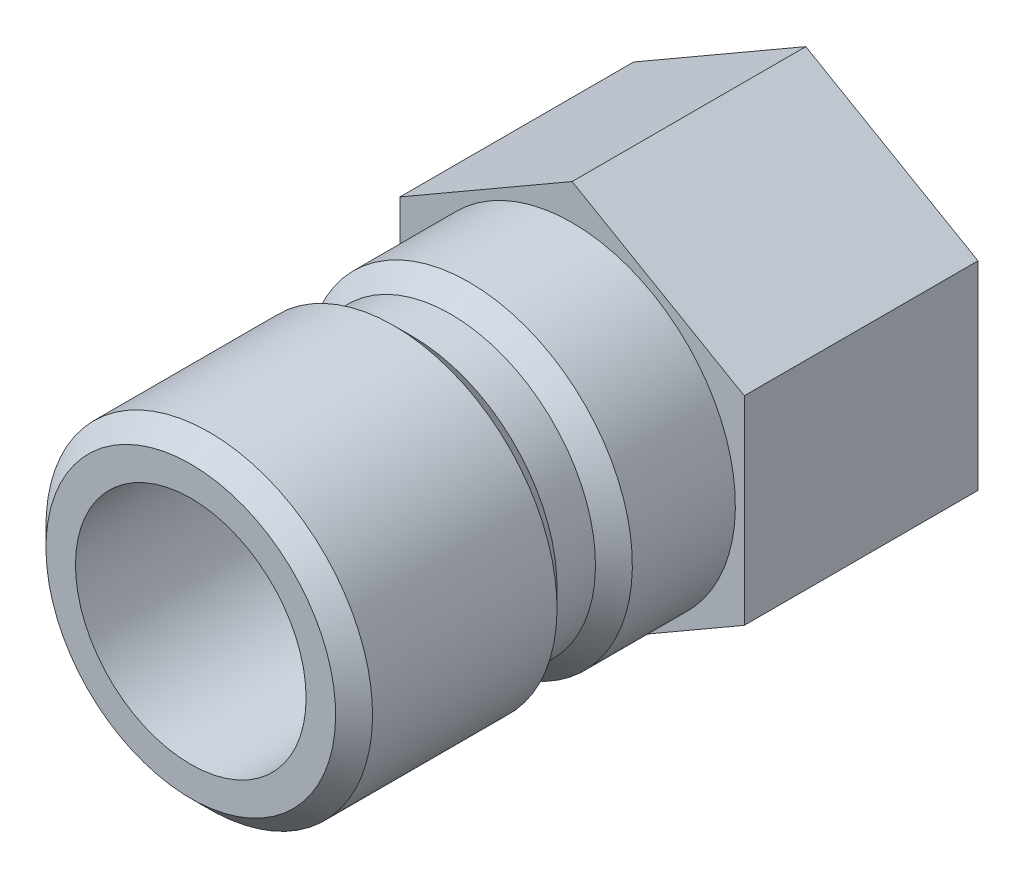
from build123d import *

# Parameters (mm, degrees)
SKETCH2_OUTSIDE_W  = 26.548
SKETCH2_OUTSIDE_H  = 26.548
CUT_EXTRUDE1_DEPTH = 21.011720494


with BuildPart() as part:
    # Sketch1 → Revolve1 (revolve)
    with BuildSketch(Plane(origin=(0, 0, 0), x_dir=(0, 0, -1), z_dir=(1, 0, 0))):
        Polygon((-15.748, 4.7625), (-15.748, 5.9817), (-14.986, 6.7437), (-7.366, 6.7437), (-6.604, 5.9817), (-5.0165, 5.9817), (-4.2545, 6.7437), (0, 6.7437), (0, 8.73125), (9.652, 8.73125), (9.652, 4.553345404), (1.7145, 4.3053), (1.7145, 4.7625), align=None)
    revolve(axis=Axis((0, 0, 0), (0, 0, 1)))

    # Sketch2 outside → Cut-Extrude1 (cut, through all)
    with BuildSketch(Plane.XY):
        Rectangle(SKETCH2_OUTSIDE_W, SKETCH2_OUTSIDE_H)
        Polygon((-7.112, 4.106115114), (-7.112, -4.106115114), (0, -8.212230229), (7.112, -4.106115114), (7.112, 4.106115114), (0, 8.212230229), align=None, mode=Mode.SUBTRACT)
    extrude(amount=-CUT_EXTRUDE1_DEPTH, mode=Mode.SUBTRACT)


solid = part.part
